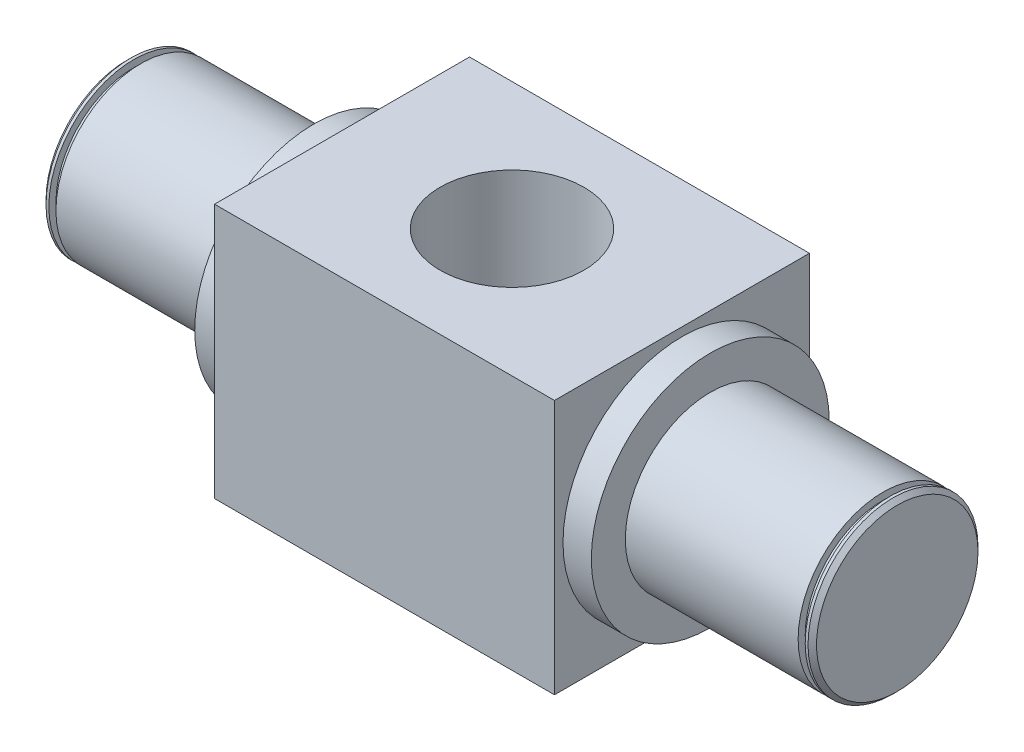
from build123d import *

# Parameters (mm, degrees)
SKETCH1_W           = 60
SKETCH1_H           = 45
SKETCH1_R           = 12.7
BOSS_EXTRUDE1_DEPTH = 45
SKETCH2_R           = 15
BOSS_EXTRUDE2_DEPTH = 38
BOSS_EXTRUDE3_START = 38
SKETCH3_R           = 15
BOSS_EXTRUDE3_DEPTH = 38
SKETCH4_R           = 21
BOSS_EXTRUDE4_DEPTH = 5
BOSS_EXTRUDE5_START = 5
SKETCH5_R           = 21
BOSS_EXTRUDE5_DEPTH = 5
CHAMFER1_SIZE       = 0.75
CUT_EXTRUDE1_START  = -1.25
SKETCH6_R           = 15
SKETCH6_R_2         = 13.75
CUT_EXTRUDE1_DEPTH  = 1.25


with BuildPart() as part:
    # Sketch1 → Boss-Extrude1 (new body)
    with BuildSketch(Plane(origin=(0, 0, 0), x_dir=(1, 0, 0), z_dir=(0, 1, 0))):
        Rectangle(SKETCH1_W, SKETCH1_H)
        with Locations(Location((0, 0, 0), (0, 0, 90))):
            Circle(SKETCH1_R, mode=Mode.SUBTRACT)
    extrude(amount=BOSS_EXTRUDE1_DEPTH)

    # Sketch2 → Boss-Extrude2 (add)
    with BuildSketch(Plane(origin=(30, 0, 0), x_dir=(0, 0, -1), z_dir=(1, 0, 0))):
        with Locations((0, 22.5)):
            Circle(SKETCH2_R)
    extrude(amount=BOSS_EXTRUDE2_DEPTH)

    # Sketch3 → Boss-Extrude3 (add)
    with BuildSketch(Plane.ZY.offset(30).offset(BOSS_EXTRUDE3_START)):
        with Locations(Location((0, 22.5, 0), (0, 0, 180))):
            Circle(SKETCH3_R)
    extrude(amount=-BOSS_EXTRUDE3_DEPTH)

    # Sketch4 → Boss-Extrude4 (add)
    with BuildSketch(Plane(origin=(30, 0, 0), x_dir=(0, 0, -1), z_dir=(1, 0, 0))):
        with Locations(Location((0, 22.5, 0), (0, 0, 180))):
            Circle(SKETCH4_R)
    extrude(amount=BOSS_EXTRUDE4_DEPTH)

    # Sketch5 → Boss-Extrude5 (add)
    with BuildSketch(Plane.ZY.offset(30).offset(BOSS_EXTRUDE5_START)):
        with Locations((0, 22.5)):
            Circle(SKETCH5_R)
    extrude(amount=-BOSS_EXTRUDE5_DEPTH)

    # Chamfer1
    chamfer1_edges = [part.edges().sort_by_distance(p)[0] for p in [
        (68, 22.5, 15),
        (-68, 22.5, 15),
    ]]
    chamfer(chamfer1_edges, length=CHAMFER1_SIZE)

    # Sketch6 → Cut-Extrude1 (cut)
    with BuildSketch(Plane.ZY.offset(68).offset(CUT_EXTRUDE1_START)):
        with Locations((0, 22.5)):
            Circle(SKETCH6_R)
        with Locations((0, 22.5)):
            Circle(SKETCH6_R_2, mode=Mode.SUBTRACT)
    cut_extrude1 = extrude(amount=-CUT_EXTRUDE1_DEPTH, mode=Mode.SUBTRACT)

    # Mirror1: Cut-Extrude1 across plane
    add(cut_extrude1.mirror(Plane(origin=(0, 0, 0), x_dir=(0, 0, 1), z_dir=(1, 0, 0))), mode=Mode.SUBTRACT)


solid = part.part
